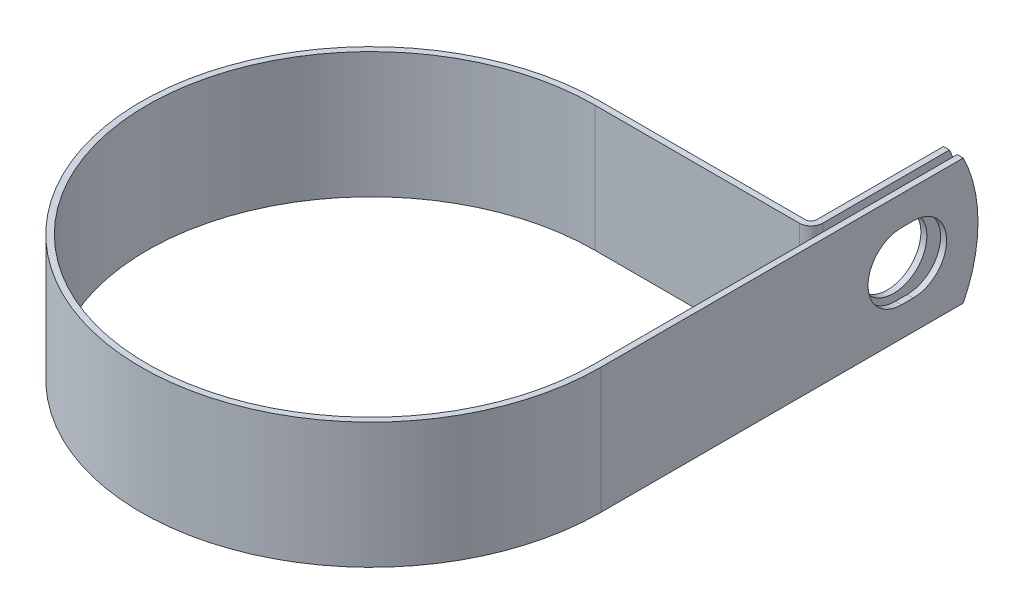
ISO-10303-21;
HEADER;
FILE_DESCRIPTION(('STEP AP214'),'2;1');
FILE_NAME('part.step','',(''),(''),'','','');
FILE_SCHEMA(('AUTOMOTIVE_DESIGN { 1 0 10303 214 1 1 1 1 }'));
ENDSEC;
DATA;
#1=APPLICATION_CONTEXT('core data for automotive mechanical design processes');
#2=APPLICATION_PROTOCOL_DEFINITION('international standard','automotive_design',2000,#1);
#3=PRODUCT_CONTEXT('',#1,'mechanical');
#4=PRODUCT('Part','Part','',(#3));
#5=PRODUCT_RELATED_PRODUCT_CATEGORY('part','',(#4));
#6=PRODUCT_DEFINITION_FORMATION('','',#4);
#7=PRODUCT_DEFINITION_CONTEXT('part definition',#1,'design');
#8=PRODUCT_DEFINITION('design','',#6,#7);
#9=PRODUCT_DEFINITION_SHAPE('','',#8);
#10=(LENGTH_UNIT() NAMED_UNIT(*) SI_UNIT(.MILLI.,.METRE.));
#11=(NAMED_UNIT(*) PLANE_ANGLE_UNIT() SI_UNIT($,.RADIAN.));
#12=(NAMED_UNIT(*) SI_UNIT($,.STERADIAN.) SOLID_ANGLE_UNIT());
#13=UNCERTAINTY_MEASURE_WITH_UNIT(LENGTH_MEASURE(1.E-05),#10,'distance_accuracy_value','');
#14=(GEOMETRIC_REPRESENTATION_CONTEXT(3) GLOBAL_UNCERTAINTY_ASSIGNED_CONTEXT((#13)) GLOBAL_UNIT_ASSIGNED_CONTEXT((#10,
#11,#12)) REPRESENTATION_CONTEXT('',''));
#15=CARTESIAN_POINT('',(0.,0.,0.));
#16=DIRECTION('',(0.,0.,1.));
#17=DIRECTION('',(1.,0.,0.));
#18=AXIS2_PLACEMENT_3D('',#15,#16,#17);
#19=CARTESIAN_POINT('',(45.2374,12.7,0.));
#20=DIRECTION('',(-1.,0.,0.));
#21=DIRECTION('',(0.,0.,1.));
#22=AXIS2_PLACEMENT_3D('',#19,#20,#21);
#23=PLANE('',#22);
#24=DIRECTION('',(0.,0.,-1.));
#25=VECTOR('',#24,1.);
#26=CARTESIAN_POINT('',(45.2374,-6.7437,-60.7059999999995));
#27=LINE('',#26,#25);
#28=CARTESIAN_POINT('',(45.2374,-6.7437,-60.7059999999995));
#29=VERTEX_POINT('',#28);
#30=CARTESIAN_POINT('',(45.2374,-6.7437,-63.0936000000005));
#31=VERTEX_POINT('',#30);
#32=EDGE_CURVE('E236',#29,#31,#27,.T.);
#33=ORIENTED_EDGE('',*,*,#32,.T.);
#34=CARTESIAN_POINT('',(45.2374,0.,-63.0935999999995));
#35=DIRECTION('',(-1.,0.,0.));
#36=DIRECTION('',(0.,0.,1.));
#37=AXIS2_PLACEMENT_3D('',#34,#35,#36);
#38=CIRCLE('',#37,6.7437);
#39=CARTESIAN_POINT('',(45.2374,6.7437,-63.0936000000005));
#40=VERTEX_POINT('',#39);
#41=EDGE_CURVE('E257',#31,#40,#38,.F.);
#42=ORIENTED_EDGE('',*,*,#41,.T.);
#43=DIRECTION('',(0.,0.,1.));
#44=VECTOR('',#43,1.);
#45=CARTESIAN_POINT('',(45.2374,6.7437,-60.7059999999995));
#46=LINE('',#45,#44);
#47=CARTESIAN_POINT('',(45.2374,6.7437,-60.7059999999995));
#48=VERTEX_POINT('',#47);
#49=EDGE_CURVE('E253',#40,#48,#46,.T.);
#50=ORIENTED_EDGE('',*,*,#49,.T.);
#51=CARTESIAN_POINT('',(45.2374,0.,-60.7059999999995));
#52=DIRECTION('',(-1.,0.,0.));
#53=DIRECTION('',(0.,0.,1.));
#54=AXIS2_PLACEMENT_3D('',#51,#52,#53);
#55=CIRCLE('',#54,6.7437);
#56=EDGE_CURVE('E248',#48,#29,#55,.F.);
#57=ORIENTED_EDGE('',*,*,#56,.T.);
#58=EDGE_LOOP('',(#33,#42,#50,#57));
#59=FACE_BOUND('',#58,.T.);
#60=CARTESIAN_POINT('',(45.2374,0.,-47.5996));
#61=DIRECTION('',(-1.,0.,0.));
#62=DIRECTION('',(0.,0.,1.));
#63=AXIS2_PLACEMENT_3D('',#60,#61,#62);
#64=CIRCLE('',#63,28.575);
#65=CARTESIAN_POINT('',(45.2374,12.7,-73.1972683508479));
#66=VERTEX_POINT('',#65);
#67=CARTESIAN_POINT('',(45.2374,-12.7,-73.1972683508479));
#68=VERTEX_POINT('',#67);
#69=EDGE_CURVE('E75',#66,#68,#64,.T.);
#70=ORIENTED_EDGE('',*,*,#69,.T.);
#71=DIRECTION('',(0.,0.,-1.));
#72=VECTOR('',#71,1.);
#73=CARTESIAN_POINT('',(45.2374,-12.7,0.));
#74=LINE('',#73,#72);
#75=CARTESIAN_POINT('',(45.2374,-12.7,0.));
#76=VERTEX_POINT('',#75);
#77=EDGE_CURVE('E271',#76,#68,#74,.T.);
#78=ORIENTED_EDGE('',*,*,#77,.F.);
#79=DIRECTION('',(0.,-1.,0.));
#80=VECTOR('',#79,1.);
#81=CARTESIAN_POINT('',(45.2374,12.7,0.));
#82=LINE('',#81,#80);
#83=CARTESIAN_POINT('',(45.2374,12.7,0.));
#84=VERTEX_POINT('',#83);
#85=EDGE_CURVE('E218',#84,#76,#82,.T.);
#86=ORIENTED_EDGE('',*,*,#85,.F.);
#87=DIRECTION('',(0.,0.,-1.));
#88=VECTOR('',#87,1.);
#89=CARTESIAN_POINT('',(45.2374,12.7,-45.2374));
#90=LINE('',#89,#88);
#91=EDGE_CURVE('E273',#84,#66,#90,.T.);
#92=ORIENTED_EDGE('',*,*,#91,.T.);
#93=EDGE_LOOP('',(#70,#78,#86,#92));
#94=FACE_BOUND('',#93,.T.);
#95=ADVANCED_FACE('F54',(#59,#94),#23,.T.);
#96=CARTESIAN_POINT('',(43.6626,12.7,-76.1746));
#97=DIRECTION('',(1.,0.,0.));
#98=DIRECTION('',(0.,0.,-1.));
#99=AXIS2_PLACEMENT_3D('',#96,#97,#98);
#100=PLANE('',#99);
#101=CARTESIAN_POINT('',(43.6626,0.,-61.8998));
#102=DIRECTION('',(1.,0.,0.));
#103=DIRECTION('',(0.,0.,-1.));
#104=AXIS2_PLACEMENT_3D('',#101,#102,#103);
#105=CIRCLE('',#104,6.7437);
#106=CARTESIAN_POINT('',(43.6626,0.,-68.6435));
#107=VERTEX_POINT('',#106);
#108=EDGE_CURVE('E268',#107,#107,#105,.F.);
#109=ORIENTED_EDGE('',*,*,#108,.T.);
#110=EDGE_LOOP('',(#109));
#111=FACE_BOUND('',#110,.T.);
#112=DIRECTION('',(0.,0.,1.));
#113=VECTOR('',#112,1.);
#114=CARTESIAN_POINT('',(43.6626,-12.7,-76.1746));
#115=LINE('',#114,#113);
#116=CARTESIAN_POINT('',(43.6626,-12.7,-73.1972683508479));
#117=VERTEX_POINT('',#116);
#118=CARTESIAN_POINT('',(43.6626,-12.7,-47.61484));
#119=VERTEX_POINT('',#118);
#120=EDGE_CURVE('E184',#117,#119,#115,.T.);
#121=ORIENTED_EDGE('',*,*,#120,.F.);
#122=CARTESIAN_POINT('',(43.6626,0.,-47.5996));
#123=DIRECTION('',(1.,0.,0.));
#124=DIRECTION('',(0.,0.,-1.));
#125=AXIS2_PLACEMENT_3D('',#122,#123,#124);
#126=CIRCLE('',#125,28.575);
#127=CARTESIAN_POINT('',(43.6626,12.7,-73.1972683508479));
#128=VERTEX_POINT('',#127);
#129=EDGE_CURVE('E176',#117,#128,#126,.T.);
#130=ORIENTED_EDGE('',*,*,#129,.T.);
#131=DIRECTION('',(0.,0.,1.));
#132=VECTOR('',#131,1.);
#133=CARTESIAN_POINT('',(43.6626,12.7,-76.1746));
#134=LINE('',#133,#132);
#135=CARTESIAN_POINT('',(43.6626,12.7,-47.61484));
#136=VERTEX_POINT('',#135);
#137=EDGE_CURVE('E224',#128,#136,#134,.T.);
#138=ORIENTED_EDGE('',*,*,#137,.T.);
#139=DIRECTION('',(0.,-1.,0.));
#140=VECTOR('',#139,1.);
#141=CARTESIAN_POINT('',(43.6626,12.7,-47.61484));
#142=LINE('',#141,#140);
#143=EDGE_CURVE('E211',#136,#119,#142,.T.);
#144=ORIENTED_EDGE('',*,*,#143,.T.);
#145=EDGE_LOOP('',(#121,#130,#138,#144));
#146=FACE_BOUND('',#145,.T.);
#147=ADVANCED_FACE('F226',(#111,#146),#100,.T.);
#148=CARTESIAN_POINT('',(42.4434,12.7,-76.1746));
#149=DIRECTION('',(1.,0.,0.));
#150=DIRECTION('',(0.,0.,-1.));
#151=AXIS2_PLACEMENT_3D('',#148,#149,#150);
#152=PLANE('',#151);
#153=CARTESIAN_POINT('',(42.4434,0.,-61.8998));
#154=DIRECTION('',(-1.,0.,0.));
#155=DIRECTION('',(0.,0.,1.));
#156=AXIS2_PLACEMENT_3D('',#153,#154,#155);
#157=CIRCLE('',#156,6.7437);
#158=CARTESIAN_POINT('',(42.4434,0.,-55.1561));
#159=VERTEX_POINT('',#158);
#160=EDGE_CURVE('E265',#159,#159,#157,.T.);
#161=ORIENTED_EDGE('',*,*,#160,.F.);
#162=EDGE_LOOP('',(#161));
#163=FACE_BOUND('',#162,.T.);
#164=CARTESIAN_POINT('',(42.4434,0.,-47.5996));
#165=DIRECTION('',(-1.,0.,0.));
#166=DIRECTION('',(0.,0.,1.));
#167=AXIS2_PLACEMENT_3D('',#164,#165,#166);
#168=CIRCLE('',#167,28.575);
#169=CARTESIAN_POINT('',(42.4434,12.7,-73.1972683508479));
#170=VERTEX_POINT('',#169);
#171=CARTESIAN_POINT('',(42.4434,-12.7,-73.1972683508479));
#172=VERTEX_POINT('',#171);
#173=EDGE_CURVE('E67',#170,#172,#168,.T.);
#174=ORIENTED_EDGE('',*,*,#173,.T.);
#175=DIRECTION('',(0.,0.,1.));
#176=VECTOR('',#175,1.);
#177=CARTESIAN_POINT('',(42.4434,-12.7,-76.1746));
#178=LINE('',#177,#176);
#179=CARTESIAN_POINT('',(42.4434,-12.7,-47.61484));
#180=VERTEX_POINT('',#179);
#181=EDGE_CURVE('E167',#172,#180,#178,.T.);
#182=ORIENTED_EDGE('',*,*,#181,.T.);
#183=DIRECTION('',(0.,-1.,0.));
#184=VECTOR('',#183,1.);
#185=CARTESIAN_POINT('',(42.4434,12.7,-47.61484));
#186=LINE('',#185,#184);
#187=CARTESIAN_POINT('',(42.4434,12.7,-47.61484));
#188=VERTEX_POINT('',#187);
#189=EDGE_CURVE('E209',#188,#180,#186,.T.);
#190=ORIENTED_EDGE('',*,*,#189,.F.);
#191=DIRECTION('',(0.,0.,1.));
#192=VECTOR('',#191,1.);
#193=CARTESIAN_POINT('',(42.4434,12.7,-76.1746));
#194=LINE('',#193,#192);
#195=EDGE_CURVE('E169',#170,#188,#194,.T.);
#196=ORIENTED_EDGE('',*,*,#195,.F.);
#197=EDGE_LOOP('',(#174,#182,#190,#196));
#198=FACE_BOUND('',#197,.T.);
#199=ADVANCED_FACE('F164',(#163,#198),#152,.F.);
#200=CARTESIAN_POINT('',(46.4566,12.7,0.));
#201=DIRECTION('',(-1.,0.,0.));
#202=DIRECTION('',(0.,0.,1.));
#203=AXIS2_PLACEMENT_3D('',#200,#201,#202);
#204=PLANE('',#203);
#205=CARTESIAN_POINT('',(46.4566,0.,-63.0935999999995));
#206=DIRECTION('',(1.,0.,0.));
#207=DIRECTION('',(0.,0.,-1.));
#208=AXIS2_PLACEMENT_3D('',#205,#206,#207);
#209=CIRCLE('',#208,6.7437);
#210=CARTESIAN_POINT('',(46.4566,-6.7437,-63.0936000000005));
#211=VERTEX_POINT('',#210);
#212=CARTESIAN_POINT('',(46.4566,6.7437,-63.0936000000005));
#213=VERTEX_POINT('',#212);
#214=EDGE_CURVE('E237',#211,#213,#209,.T.);
#215=ORIENTED_EDGE('',*,*,#214,.F.);
#216=DIRECTION('',(0.,0.,-1.));
#217=VECTOR('',#216,1.);
#218=CARTESIAN_POINT('',(46.4566,-6.7437,-60.7059999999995));
#219=LINE('',#218,#217);
#220=CARTESIAN_POINT('',(46.4566,-6.7437,-60.7059999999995));
#221=VERTEX_POINT('',#220);
#222=EDGE_CURVE('E240',#221,#211,#219,.T.);
#223=ORIENTED_EDGE('',*,*,#222,.F.);
#224=CARTESIAN_POINT('',(46.4566,0.,-60.7059999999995));
#225=DIRECTION('',(1.,0.,0.));
#226=DIRECTION('',(0.,0.,-1.));
#227=AXIS2_PLACEMENT_3D('',#224,#225,#226);
#228=CIRCLE('',#227,6.7437);
#229=CARTESIAN_POINT('',(46.4566,6.7437,-60.7059999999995));
#230=VERTEX_POINT('',#229);
#231=EDGE_CURVE('E230',#230,#221,#228,.T.);
#232=ORIENTED_EDGE('',*,*,#231,.F.);
#233=DIRECTION('',(0.,0.,1.));
#234=VECTOR('',#233,1.);
#235=CARTESIAN_POINT('',(46.4566,6.7437,-60.7059999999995));
#236=LINE('',#235,#234);
#237=EDGE_CURVE('E234',#213,#230,#236,.T.);
#238=ORIENTED_EDGE('',*,*,#237,.F.);
#239=EDGE_LOOP('',(#215,#223,#232,#238));
#240=FACE_BOUND('',#239,.T.);
#241=DIRECTION('',(0.,0.,-1.));
#242=VECTOR('',#241,1.);
#243=CARTESIAN_POINT('',(46.4566,-12.7,0.));
#244=LINE('',#243,#242);
#245=CARTESIAN_POINT('',(46.4566,-12.7,0.));
#246=VERTEX_POINT('',#245);
#247=CARTESIAN_POINT('',(46.4566,-12.7,-73.1972683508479));
#248=VERTEX_POINT('',#247);
#249=EDGE_CURVE('E195',#246,#248,#244,.T.);
#250=ORIENTED_EDGE('',*,*,#249,.T.);
#251=CARTESIAN_POINT('',(46.4566,0.,-47.5996));
#252=DIRECTION('',(-1.,0.,0.));
#253=DIRECTION('',(0.,0.,1.));
#254=AXIS2_PLACEMENT_3D('',#251,#252,#253);
#255=CIRCLE('',#254,28.575);
#256=CARTESIAN_POINT('',(46.4566,12.7,-73.1972683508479));
#257=VERTEX_POINT('',#256);
#258=EDGE_CURVE('E170',#257,#248,#255,.T.);
#259=ORIENTED_EDGE('',*,*,#258,.F.);
#260=DIRECTION('',(0.,0.,-1.));
#261=VECTOR('',#260,1.);
#262=CARTESIAN_POINT('',(46.4566,12.7,-45.2374));
#263=LINE('',#262,#261);
#264=CARTESIAN_POINT('',(46.4566,12.7,0.));
#265=VERTEX_POINT('',#264);
#266=EDGE_CURVE('E198',#265,#257,#263,.T.);
#267=ORIENTED_EDGE('',*,*,#266,.F.);
#268=DIRECTION('',(0.,-1.,0.));
#269=VECTOR('',#268,1.);
#270=CARTESIAN_POINT('',(46.4566,12.7,0.));
#271=LINE('',#270,#269);
#272=EDGE_CURVE('E199',#265,#246,#271,.T.);
#273=ORIENTED_EDGE('',*,*,#272,.T.);
#274=EDGE_LOOP('',(#250,#259,#267,#273));
#275=FACE_BOUND('',#274,.T.);
#276=ADVANCED_FACE('F321',(#240,#275),#204,.F.);
#277=CARTESIAN_POINT('',(0.,-12.7,0.));
#278=DIRECTION('',(0.,1.,0.));
#279=DIRECTION('',(1.,0.,0.));
#280=AXIS2_PLACEMENT_3D('',#277,#278,#279);
#281=PLANE('',#280);
#282=DIRECTION('',(-1.,0.,0.));
#283=VECTOR('',#282,1.);
#284=CARTESIAN_POINT('',(46.4566,-12.7,-73.1972683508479));
#285=LINE('',#284,#283);
#286=EDGE_CURVE('E171',#248,#68,#285,.T.);
#287=ORIENTED_EDGE('',*,*,#286,.F.);
#288=ORIENTED_EDGE('',*,*,#249,.F.);
#289=CARTESIAN_POINT('',(0.,-12.7,0.));
#290=DIRECTION('',(0.,1.,0.));
#291=DIRECTION('',(1.,0.,0.));
#292=AXIS2_PLACEMENT_3D('',#289,#290,#291);
#293=CIRCLE('',#292,46.4566);
#294=CARTESIAN_POINT('',(0.,-12.7,-46.4566));
#295=VERTEX_POINT('',#294);
#296=EDGE_CURVE('E193',#295,#246,#293,.T.);
#297=ORIENTED_EDGE('',*,*,#296,.F.);
#298=DIRECTION('',(1.,0.,0.));
#299=VECTOR('',#298,1.);
#300=CARTESIAN_POINT('',(0.,-12.7,-46.4566));
#301=LINE('',#300,#299);
#302=CARTESIAN_POINT('',(41.28516,-12.7,-46.4566));
#303=VERTEX_POINT('',#302);
#304=EDGE_CURVE('E186',#303,#295,#301,.F.);
#305=ORIENTED_EDGE('',*,*,#304,.F.);
#306=CARTESIAN_POINT('',(41.28516,-12.7,-47.61484));
#307=DIRECTION('',(0.,1.,0.));
#308=DIRECTION('',(1.,0.,0.));
#309=AXIS2_PLACEMENT_3D('',#306,#307,#308);
#310=CIRCLE('',#309,1.15824000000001);
#311=EDGE_CURVE('E183',#180,#303,#310,.F.);
#312=ORIENTED_EDGE('',*,*,#311,.F.);
#313=ORIENTED_EDGE('',*,*,#181,.F.);
#314=DIRECTION('',(-1.,0.,0.));
#315=VECTOR('',#314,1.);
#316=CARTESIAN_POINT('',(46.4566,-12.7,-73.1972683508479));
#317=LINE('',#316,#315);
#318=EDGE_CURVE('E12',#117,#172,#317,.T.);
#319=ORIENTED_EDGE('',*,*,#318,.F.);
#320=ORIENTED_EDGE('',*,*,#120,.T.);
#321=CARTESIAN_POINT('',(41.28516,-12.7,-47.61484));
#322=DIRECTION('',(0.,-1.,0.));
#323=DIRECTION('',(0.,0.,1.));
#324=AXIS2_PLACEMENT_3D('',#321,#322,#323);
#325=CIRCLE('',#324,2.37744);
#326=CARTESIAN_POINT('',(41.28516,-12.7,-45.2374));
#327=VERTEX_POINT('',#326);
#328=EDGE_CURVE('E188',#119,#327,#325,.T.);
#329=ORIENTED_EDGE('',*,*,#328,.T.);
#330=DIRECTION('',(-1.,0.,0.));
#331=VECTOR('',#330,1.);
#332=CARTESIAN_POINT('',(0.,-12.7,-45.2374));
#333=LINE('',#332,#331);
#334=CARTESIAN_POINT('',(0.,-12.7,-45.2374));
#335=VERTEX_POINT('',#334);
#336=EDGE_CURVE('E298',#327,#335,#333,.T.);
#337=ORIENTED_EDGE('',*,*,#336,.T.);
#338=CARTESIAN_POINT('',(0.,-12.7,0.));
#339=DIRECTION('',(0.,1.,0.));
#340=DIRECTION('',(0.,0.,1.));
#341=AXIS2_PLACEMENT_3D('',#338,#339,#340);
#342=CIRCLE('',#341,45.2374);
#343=EDGE_CURVE('E295',#335,#76,#342,.T.);
#344=ORIENTED_EDGE('',*,*,#343,.T.);
#345=ORIENTED_EDGE('',*,*,#77,.T.);
#346=EDGE_LOOP('',(#287,#288,#297,#305,#312,#313,#319,#320,#329,#337,#344,#345));
#347=FACE_BOUND('',#346,.T.);
#348=ADVANCED_FACE('F181',(#347),#281,.F.);
#349=CARTESIAN_POINT('',(0.,12.7,0.));
#350=DIRECTION('',(0.,1.,0.));
#351=DIRECTION('',(1.,0.,0.));
#352=AXIS2_PLACEMENT_3D('',#349,#350,#351);
#353=PLANE('',#352);
#354=ORIENTED_EDGE('',*,*,#266,.T.);
#355=DIRECTION('',(-1.,0.,0.));
#356=VECTOR('',#355,1.);
#357=CARTESIAN_POINT('',(46.4566,12.7,-73.1972683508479));
#358=LINE('',#357,#356);
#359=EDGE_CURVE('E228',#257,#66,#358,.T.);
#360=ORIENTED_EDGE('',*,*,#359,.T.);
#361=ORIENTED_EDGE('',*,*,#91,.F.);
#362=CARTESIAN_POINT('',(0.,12.7,0.));
#363=DIRECTION('',(0.,1.,0.));
#364=DIRECTION('',(0.,0.,1.));
#365=AXIS2_PLACEMENT_3D('',#362,#363,#364);
#366=CIRCLE('',#365,45.2374);
#367=CARTESIAN_POINT('',(0.,12.7,-45.2374));
#368=VERTEX_POINT('',#367);
#369=EDGE_CURVE('E276',#368,#84,#366,.T.);
#370=ORIENTED_EDGE('',*,*,#369,.F.);
#371=DIRECTION('',(-1.,0.,0.));
#372=VECTOR('',#371,1.);
#373=CARTESIAN_POINT('',(0.,12.7,-45.2374));
#374=LINE('',#373,#372);
#375=CARTESIAN_POINT('',(41.28516,12.7,-45.2374));
#376=VERTEX_POINT('',#375);
#377=EDGE_CURVE('E279',#376,#368,#374,.T.);
#378=ORIENTED_EDGE('',*,*,#377,.F.);
#379=CARTESIAN_POINT('',(41.28516,12.7,-47.61484));
#380=DIRECTION('',(0.,-1.,0.));
#381=DIRECTION('',(0.,0.,1.));
#382=AXIS2_PLACEMENT_3D('',#379,#380,#381);
#383=CIRCLE('',#382,2.37744);
#384=EDGE_CURVE('E282',#136,#376,#383,.T.);
#385=ORIENTED_EDGE('',*,*,#384,.F.);
#386=ORIENTED_EDGE('',*,*,#137,.F.);
#387=DIRECTION('',(-1.,0.,0.));
#388=VECTOR('',#387,1.);
#389=CARTESIAN_POINT('',(46.4566,12.7,-73.1972683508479));
#390=LINE('',#389,#388);
#391=EDGE_CURVE('E61',#128,#170,#390,.T.);
#392=ORIENTED_EDGE('',*,*,#391,.T.);
#393=ORIENTED_EDGE('',*,*,#195,.T.);
#394=CARTESIAN_POINT('',(41.28516,12.7,-47.61484));
#395=DIRECTION('',(0.,1.,0.));
#396=DIRECTION('',(1.,0.,0.));
#397=AXIS2_PLACEMENT_3D('',#394,#395,#396);
#398=CIRCLE('',#397,1.15824000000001);
#399=CARTESIAN_POINT('',(41.28516,12.7,-46.4566));
#400=VERTEX_POINT('',#399);
#401=EDGE_CURVE('E287',#188,#400,#398,.F.);
#402=ORIENTED_EDGE('',*,*,#401,.T.);
#403=DIRECTION('',(1.,0.,0.));
#404=VECTOR('',#403,1.);
#405=CARTESIAN_POINT('',(0.,12.7,-46.4566));
#406=LINE('',#405,#404);
#407=CARTESIAN_POINT('',(0.,12.7,-46.4566));
#408=VERTEX_POINT('',#407);
#409=EDGE_CURVE('E289',#400,#408,#406,.F.);
#410=ORIENTED_EDGE('',*,*,#409,.T.);
#411=CARTESIAN_POINT('',(0.,12.7,0.));
#412=DIRECTION('',(0.,1.,0.));
#413=DIRECTION('',(1.,0.,0.));
#414=AXIS2_PLACEMENT_3D('',#411,#412,#413);
#415=CIRCLE('',#414,46.4566);
#416=EDGE_CURVE('E203',#408,#265,#415,.T.);
#417=ORIENTED_EDGE('',*,*,#416,.T.);
#418=EDGE_LOOP('',(#354,#360,#361,#370,#378,#385,#386,#392,#393,#402,#410,#417));
#419=FACE_BOUND('',#418,.T.);
#420=ADVANCED_FACE('F222',(#419),#353,.T.);
#421=CARTESIAN_POINT('',(0.,12.7,0.));
#422=DIRECTION('',(0.,-1.,0.));
#423=DIRECTION('',(0.,0.,-1.));
#424=AXIS2_PLACEMENT_3D('',#421,#422,#423);
#425=CYLINDRICAL_SURFACE('',#424,45.2374);
#426=ORIENTED_EDGE('',*,*,#343,.F.);
#427=DIRECTION('',(0.,-1.,0.));
#428=VECTOR('',#427,1.);
#429=CARTESIAN_POINT('',(0.,12.7,-45.2374));
#430=LINE('',#429,#428);
#431=EDGE_CURVE('E216',#368,#335,#430,.T.);
#432=ORIENTED_EDGE('',*,*,#431,.F.);
#433=ORIENTED_EDGE('',*,*,#369,.T.);
#434=ORIENTED_EDGE('',*,*,#85,.T.);
#435=EDGE_LOOP('',(#426,#432,#433,#434));
#436=FACE_BOUND('',#435,.T.);
#437=ADVANCED_FACE('F311',(#436),#425,.F.);
#438=CARTESIAN_POINT('',(0.,12.7,-45.2374));
#439=DIRECTION('',(0.,0.,1.));
#440=DIRECTION('',(1.,0.,0.));
#441=AXIS2_PLACEMENT_3D('',#438,#439,#440);
#442=PLANE('',#441);
#443=ORIENTED_EDGE('',*,*,#336,.F.);
#444=DIRECTION('',(0.,-1.,0.));
#445=VECTOR('',#444,1.);
#446=CARTESIAN_POINT('',(41.28516,12.7,-45.2374));
#447=LINE('',#446,#445);
#448=EDGE_CURVE('E214',#376,#327,#447,.T.);
#449=ORIENTED_EDGE('',*,*,#448,.F.);
#450=ORIENTED_EDGE('',*,*,#377,.T.);
#451=ORIENTED_EDGE('',*,*,#431,.T.);
#452=EDGE_LOOP('',(#443,#449,#450,#451));
#453=FACE_BOUND('',#452,.T.);
#454=ADVANCED_FACE('F307',(#453),#442,.T.);
#455=CARTESIAN_POINT('',(41.28516,12.7,-47.61484));
#456=DIRECTION('',(0.,-1.,0.));
#457=DIRECTION('',(0.,0.,-1.));
#458=AXIS2_PLACEMENT_3D('',#455,#456,#457);
#459=CYLINDRICAL_SURFACE('',#458,2.37744);
#460=ORIENTED_EDGE('',*,*,#328,.F.);
#461=ORIENTED_EDGE('',*,*,#143,.F.);
#462=ORIENTED_EDGE('',*,*,#384,.T.);
#463=ORIENTED_EDGE('',*,*,#448,.T.);
#464=EDGE_LOOP('',(#460,#461,#462,#463));
#465=FACE_BOUND('',#464,.T.);
#466=ADVANCED_FACE('F304',(#465),#459,.T.);
#467=CARTESIAN_POINT('',(41.28516,12.7,-47.61484));
#468=DIRECTION('',(0.,-1.,0.));
#469=DIRECTION('',(0.,0.,-1.));
#470=AXIS2_PLACEMENT_3D('',#467,#468,#469);
#471=CYLINDRICAL_SURFACE('',#470,1.15824000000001);
#472=ORIENTED_EDGE('',*,*,#311,.T.);
#473=DIRECTION('',(0.,-1.,0.));
#474=VECTOR('',#473,1.);
#475=CARTESIAN_POINT('',(41.28516,12.7,-46.4566));
#476=LINE('',#475,#474);
#477=EDGE_CURVE('E206',#400,#303,#476,.T.);
#478=ORIENTED_EDGE('',*,*,#477,.F.);
#479=ORIENTED_EDGE('',*,*,#401,.F.);
#480=ORIENTED_EDGE('',*,*,#189,.T.);
#481=EDGE_LOOP('',(#472,#478,#479,#480));
#482=FACE_BOUND('',#481,.T.);
#483=ADVANCED_FACE('F334',(#482),#471,.F.);
#484=CARTESIAN_POINT('',(0.,12.7,-46.4566));
#485=DIRECTION('',(0.,0.,1.));
#486=DIRECTION('',(1.,0.,0.));
#487=AXIS2_PLACEMENT_3D('',#484,#485,#486);
#488=PLANE('',#487);
#489=ORIENTED_EDGE('',*,*,#304,.T.);
#490=DIRECTION('',(0.,-1.,0.));
#491=VECTOR('',#490,1.);
#492=CARTESIAN_POINT('',(0.,12.7,-46.4566));
#493=LINE('',#492,#491);
#494=EDGE_CURVE('E202',#408,#295,#493,.T.);
#495=ORIENTED_EDGE('',*,*,#494,.F.);
#496=ORIENTED_EDGE('',*,*,#409,.F.);
#497=ORIENTED_EDGE('',*,*,#477,.T.);
#498=EDGE_LOOP('',(#489,#495,#496,#497));
#499=FACE_BOUND('',#498,.T.);
#500=ADVANCED_FACE('F330',(#499),#488,.F.);
#501=CARTESIAN_POINT('',(0.,12.7,0.));
#502=DIRECTION('',(0.,-1.,0.));
#503=DIRECTION('',(0.,0.,-1.));
#504=AXIS2_PLACEMENT_3D('',#501,#502,#503);
#505=CYLINDRICAL_SURFACE('',#504,46.4566);
#506=ORIENTED_EDGE('',*,*,#296,.T.);
#507=ORIENTED_EDGE('',*,*,#272,.F.);
#508=ORIENTED_EDGE('',*,*,#416,.F.);
#509=ORIENTED_EDGE('',*,*,#494,.T.);
#510=EDGE_LOOP('',(#506,#507,#508,#509));
#511=FACE_BOUND('',#510,.T.);
#512=ADVANCED_FACE('F327',(#511),#505,.T.);
#513=CARTESIAN_POINT('',(62.7366640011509,0.,-61.8998));
#514=DIRECTION('',(-1.,0.,0.));
#515=DIRECTION('',(0.,0.,1.));
#516=AXIS2_PLACEMENT_3D('',#513,#514,#515);
#517=CYLINDRICAL_SURFACE('',#516,6.7437);
#518=ORIENTED_EDGE('',*,*,#160,.T.);
#519=EDGE_LOOP('',(#518));
#520=FACE_BOUND('',#519,.T.);
#521=ORIENTED_EDGE('',*,*,#108,.F.);
#522=EDGE_LOOP('',(#521));
#523=FACE_BOUND('',#522,.T.);
#524=ADVANCED_FACE('F379',(#520,#523),#517,.F.);
#525=CARTESIAN_POINT('',(24.4065194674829,-6.7437,-60.7059999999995));
#526=DIRECTION('',(0.,-1.,0.));
#527=DIRECTION('',(0.,0.,-1.));
#528=AXIS2_PLACEMENT_3D('',#525,#526,#527);
#529=PLANE('',#528);
#530=DIRECTION('',(1.,0.,0.));
#531=VECTOR('',#530,1.);
#532=CARTESIAN_POINT('',(24.4065194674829,-6.7437,-60.7059999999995));
#533=LINE('',#532,#531);
#534=EDGE_CURVE('E251',#29,#221,#533,.T.);
#535=ORIENTED_EDGE('',*,*,#534,.T.);
#536=ORIENTED_EDGE('',*,*,#222,.T.);
#537=DIRECTION('',(1.,0.,0.));
#538=VECTOR('',#537,1.);
#539=CARTESIAN_POINT('',(24.4065194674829,-6.7437,-63.0936000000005));
#540=LINE('',#539,#538);
#541=EDGE_CURVE('E247',#31,#211,#540,.T.);
#542=ORIENTED_EDGE('',*,*,#541,.F.);
#543=ORIENTED_EDGE('',*,*,#32,.F.);
#544=EDGE_LOOP('',(#535,#536,#542,#543));
#545=FACE_BOUND('',#544,.T.);
#546=ADVANCED_FACE('F354',(#545),#529,.F.);
#547=CARTESIAN_POINT('',(24.4065194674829,0.,-63.0935999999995));
#548=DIRECTION('',(1.,0.,0.));
#549=DIRECTION('',(0.,0.,-1.));
#550=AXIS2_PLACEMENT_3D('',#547,#548,#549);
#551=CYLINDRICAL_SURFACE('',#550,6.7437);
#552=ORIENTED_EDGE('',*,*,#541,.T.);
#553=ORIENTED_EDGE('',*,*,#214,.T.);
#554=DIRECTION('',(1.,0.,0.));
#555=VECTOR('',#554,1.);
#556=CARTESIAN_POINT('',(24.4065194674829,6.7437,-63.0936000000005));
#557=LINE('',#556,#555);
#558=EDGE_CURVE('E256',#40,#213,#557,.T.);
#559=ORIENTED_EDGE('',*,*,#558,.F.);
#560=ORIENTED_EDGE('',*,*,#41,.F.);
#561=EDGE_LOOP('',(#552,#553,#559,#560));
#562=FACE_BOUND('',#561,.T.);
#563=ADVANCED_FACE('F358',(#562),#551,.F.);
#564=CARTESIAN_POINT('',(24.4065194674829,6.7437,-60.7059999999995));
#565=DIRECTION('',(0.,1.,0.));
#566=DIRECTION('',(0.,0.,1.));
#567=AXIS2_PLACEMENT_3D('',#564,#565,#566);
#568=PLANE('',#567);
#569=ORIENTED_EDGE('',*,*,#558,.T.);
#570=ORIENTED_EDGE('',*,*,#237,.T.);
#571=DIRECTION('',(1.,0.,0.));
#572=VECTOR('',#571,1.);
#573=CARTESIAN_POINT('',(24.4065194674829,6.7437,-60.7059999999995));
#574=LINE('',#573,#572);
#575=EDGE_CURVE('E252',#48,#230,#574,.T.);
#576=ORIENTED_EDGE('',*,*,#575,.F.);
#577=ORIENTED_EDGE('',*,*,#49,.F.);
#578=EDGE_LOOP('',(#569,#570,#576,#577));
#579=FACE_BOUND('',#578,.T.);
#580=ADVANCED_FACE('F362',(#579),#568,.F.);
#581=CARTESIAN_POINT('',(24.4065194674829,0.,-60.7059999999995));
#582=DIRECTION('',(1.,0.,0.));
#583=DIRECTION('',(0.,0.,-1.));
#584=AXIS2_PLACEMENT_3D('',#581,#582,#583);
#585=CYLINDRICAL_SURFACE('',#584,6.7437);
#586=ORIENTED_EDGE('',*,*,#575,.T.);
#587=ORIENTED_EDGE('',*,*,#231,.T.);
#588=ORIENTED_EDGE('',*,*,#534,.F.);
#589=ORIENTED_EDGE('',*,*,#56,.F.);
#590=EDGE_LOOP('',(#586,#587,#588,#589));
#591=FACE_BOUND('',#590,.T.);
#592=ADVANCED_FACE('F366',(#591),#585,.F.);
#593=CARTESIAN_POINT('',(46.4566,0.,-47.5996));
#594=DIRECTION('',(-1.,0.,0.));
#595=DIRECTION('',(0.,0.,1.));
#596=AXIS2_PLACEMENT_3D('',#593,#594,#595);
#597=CYLINDRICAL_SURFACE('',#596,28.575);
#598=ORIENTED_EDGE('',*,*,#129,.F.);
#599=ORIENTED_EDGE('',*,*,#318,.T.);
#600=ORIENTED_EDGE('',*,*,#173,.F.);
#601=ORIENTED_EDGE('',*,*,#391,.F.);
#602=EDGE_LOOP('',(#598,#599,#600,#601));
#603=FACE_BOUND('',#602,.T.);
#604=ADVANCED_FACE('F174',(#603),#597,.T.);
#605=ORIENTED_EDGE('',*,*,#359,.F.);
#606=ORIENTED_EDGE('',*,*,#258,.T.);
#607=ORIENTED_EDGE('',*,*,#286,.T.);
#608=ORIENTED_EDGE('',*,*,#69,.F.);
#609=EDGE_LOOP('',(#605,#606,#607,#608));
#610=FACE_BOUND('',#609,.T.);
#611=ADVANCED_FACE('F316',(#610),#597,.T.);
#612=CLOSED_SHELL('',(#95,#147,#199,#276,#348,#420,#437,#454,#466,#483,#500,#512,#524,#546,#563,
#580,#592,#604,#611));
#613=MANIFOLD_SOLID_BREP('B2',#612);
#614=ADVANCED_BREP_SHAPE_REPRESENTATION('',(#18,#613),#14);
#615=SHAPE_DEFINITION_REPRESENTATION(#9,#614);
ENDSEC;
END-ISO-10303-21;
